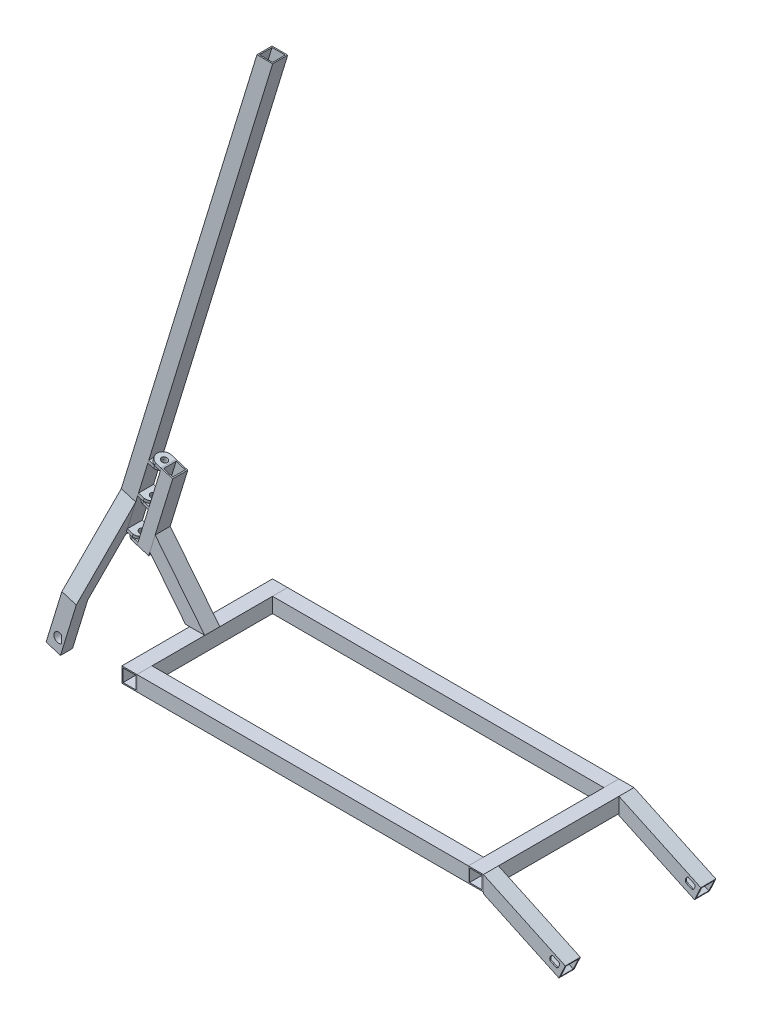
from build123d import *

# Parameters (mm, degrees)
SKETCH1_W                       = 25
SKETCH1_H                       = 25
SKETCH1_W_2                     = 21
SKETCH1_H_2                     = 21
BOSS_EXTRUDE1_DEPTH             = 550
BOSS_EXTRUDE1_2_DEPTH           = 550
SKETCH2_W                       = 25
SKETCH2_H                       = 25
SKETCH2_W_2                     = 21
SKETCH2_H_2                     = 21
BOSS_EXTRUDE2_DEPTH             = 250
SKETCH3_W                       = 25
SKETCH3_H                       = 25
SKETCH3_W_2                     = 21
SKETCH3_H_2                     = 21
BOSS_EXTRUDE3_DEPTH             = 250
BOSS_EXTRUDE4_DEPTH             = 25
CUT_EXTRUDE1_REACH              = 706.956
SKETCH5_W                       = 21
SKETCH5_H                       = 21
CUT_EXTRUDE2_START              = -250
CUT_EXTRUDE2_DEPTH              = 250
BOSS_EXTRUDE5_DEPTH             = 12.5
BOSS_EXTRUDE5_DEPTH_BACK        = 12.5
BOSS_EXTRUDE6_REACH             = 740.009
BOSS_EXTRUDE6_DIRECTION_2_REACH = 740.009
CUT_EXTRUDE3_REACH              = 1102.678
SKETCH10_W                      = 21
SKETCH10_H                      = 21
BOSS_EXTRUDE7_DEPTH             = 25
CUT_EXTRUDE4_DEPTH              = 25
SKETCH14_W                      = 25
SKETCH14_H                      = 136.591840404
BOSS_EXTRUDE8_DEPTH             = 20
SKETCH15_W                      = 16
SKETCH15_H                      = 21
CUT_EXTRUDE5_DEPTH              = 136.591840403
CUT_EXTRUDE6_DEPTH              = 20
SKETCH17_R                      = 5
BOSS_EXTRUDE9_DEPTH             = 5
SKETCH18_R                      = 5
BOSS_EXTRUDE10_DEPTH            = 5
SKETCH19_R                      = 5
BOSS_EXTRUDE11_DEPTH            = 5
SKETCH20_R                      = 5
BOSS_EXTRUDE12_DEPTH            = 5
SKETCH21_R                      = 5
BOSS_EXTRUDE13_DEPTH            = 5
SKETCH22_R                      = 5
BOSS_EXTRUDE14_DEPTH            = 5


with BuildPart() as part:
    # Sketch1 → Boss-Extrude1 (new body)
    with BuildSketch(Plane(origin=(0, 0, 0), x_dir=(0, 0, -1), z_dir=(1, 0, 0))):
        with Locations((-112.5, 0)):
            Rectangle(SKETCH1_W, SKETCH1_H)
        with Locations((-112.5, 0)):
            Rectangle(SKETCH1_W_2, SKETCH1_H_2, mode=Mode.SUBTRACT)
    extrude(amount=BOSS_EXTRUDE1_DEPTH)


with BuildPart() as body_2:
    # Sketch1 → Boss-Extrude1 2 (new body)
    with BuildSketch(Plane(origin=(0, 0, 0), x_dir=(0, 0, -1), z_dir=(1, 0, 0))):
        with Locations((112.5, 0)):
            Rectangle(SKETCH1_W, SKETCH1_H)
        with Locations((112.5, 0)):
            Rectangle(SKETCH1_W_2, SKETCH1_H_2, mode=Mode.SUBTRACT)
    extrude(amount=BOSS_EXTRUDE1_2_DEPTH)


with BuildPart() as body_3:
    # Sketch2 → Boss-Extrude2 (new body)
    with BuildSketch(Plane(origin=(0, 0, -125), x_dir=(-1, 0, 0), z_dir=(0, 0, -1))):
        with Locations((12.5, 0)):
            Rectangle(SKETCH2_W, SKETCH2_H)
        with Locations((12.5, 0)):
            Rectangle(SKETCH2_W_2, SKETCH2_H_2, mode=Mode.SUBTRACT)
    extrude(amount=-BOSS_EXTRUDE2_DEPTH)


with BuildPart() as body_4:
    # Sketch3 → Boss-Extrude3 (new body)
    with BuildSketch(Plane.XY.offset(125)):
        with Locations((562.5, 0)):
            Rectangle(SKETCH3_W, SKETCH3_H)
        with Locations((562.5, 0)):
            Rectangle(SKETCH3_W_2, SKETCH3_H_2, mode=Mode.SUBTRACT)
    extrude(amount=-BOSS_EXTRUDE3_DEPTH)


with BuildPart() as body_5:
    # Sketch4 → Boss-Extrude4 (new body)
    with BuildSketch(Plane.XY.offset(125)):
        Polygon((575, 12.5), (575, -15.084447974), (700.380711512, -73.550433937), (710.946168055, -50.892739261), align=None)
    extrude(amount=-BOSS_EXTRUDE4_DEPTH)

    # Cut-Extrude1: up to this plane
    cut_extrude1_end = Plane(origin=(575, 12.5, 100), z_dir=(-1, 0, 0))
    # Sketch5 → Cut-Extrude1 (cut, up to the surface)
    with BuildSketch(Plane(origin=(603.459828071, -281.397939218, 0), x_dir=(0, 0, -1), z_dir=(0.9063077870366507, -0.42261826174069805, 0)), mode=Mode.PRIVATE) as cut_extrude1_sk1:
        with Locations((-112.5, 241.834347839)):
            Rectangle(SKETCH5_W, SKETCH5_H)
    cut_extrude1_tool1 = split(extrude(cut_extrude1_sk1.sketch, amount=-CUT_EXTRUDE1_REACH, mode=Mode.PRIVATE), bisect_by=cut_extrude1_end, keep=Keep.BOTH, mode=Mode.PRIVATE)
    add(cut_extrude1_tool1.solids().sort_by_distance((705.66344, -62.221587, 112.5))[0], mode=Mode.SUBTRACT)


with BuildPart() as body_6:
    # Mirror2: mirrored copy
    add(body_5.part.mirror(Plane.XY))


with BuildPart() as cut_extrude2_tool:
    # Sketch7 → Cut-Extrude2 (new body)
    with BuildSketch(Plane(origin=(0, 0, -125), x_dir=(-1, 0, 0), z_dir=(0, 0, -1)).offset(CUT_EXTRUDE2_START)):
        with BuildLine():
            Line((-700.799500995, -51.356522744), (-689.92380755, -46.285103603))
            ThreePointArc((-689.92380755, -46.285103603), (-685.874906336, -50.235597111), (-685.45123627, -55.876563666))
            Line((-685.45123627, -55.876563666), (-696.326929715, -60.947982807))
            ThreePointArc((-696.326929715, -60.947982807), (-700.375830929, -56.997489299), (-700.799500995, -51.356522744))
        make_face()
    extrude(amount=CUT_EXTRUDE2_DEPTH)


with BuildPart() as body_5_1:
    add(body_5.part)

    # Cut-Extrude2: cut by cut_extrude2_tool
    add(cut_extrude2_tool.part, mode=Mode.SUBTRACT)


with BuildPart() as body_6_1:
    add(body_6.part)

    # Cut-Extrude2: cut by cut_extrude2_tool
    add(cut_extrude2_tool.part, mode=Mode.SUBTRACT)


with BuildPart() as body_7:
    # Sketch8 → Boss-Extrude5 (new, two sides: drawn at the far end of the back side and taken through both)
    with BuildSketch(Plane.XY.offset(-BOSS_EXTRUDE5_DEPTH_BACK)):
        Polygon((0, 12.5), (-112.52508315, 153.585441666), (-121.386292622, 124.601731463), (-31.977658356, 12.5), align=None)
    extrude(amount=BOSS_EXTRUDE5_DEPTH + BOSS_EXTRUDE5_DEPTH_BACK)


with BuildPart() as body_8:

    # Boss-Extrude6: up to this face of the body (flat: up to its plane)
    boss_extrude6_end = Plane(body_7.part.faces().sort_by_distance((-66.08267129, 76.073286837, 12.5))[0])
    # Sketch9 → Boss-Extrude6 (new, up to the picked face)
    with BuildSketch(Plane.XY, mode=Mode.PRIVATE) as boss_extrude6_sk1:
        Polygon((-131.351338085, 92.007536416), (-155.258956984, 99.316829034), (86.636741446, 890.522007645), (112.779035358, 890.522007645), align=None)
    boss_extrude6_tool1 = split(extrude(boss_extrude6_sk1.sketch, amount=BOSS_EXTRUDE6_REACH, mode=Mode.PRIVATE), bisect_by=boss_extrude6_end, keep=Keep.BOTH, mode=Mode.PRIVATE)
    add(boss_extrude6_tool1.solids().sort_by(Axis((-21.779453, 493.089295, 0), (0, 0, 1)))[0])


    # Boss-Extrude6 direction 2: up to this face of the body (flat: up to its plane)
    boss_extrude6_direction_2_end = Plane(body_7.part.faces().sort_by_distance((-66.08267129, 76.073286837, -12.5))[0])
    # Sketch9 → Boss-Extrude6 direction 2 (add, up to the picked face)
    with BuildSketch(Plane.XY, mode=Mode.PRIVATE) as boss_extrude6_direction_2_sk1:
        Polygon((-131.351338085, 92.007536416), (-155.258956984, 99.316829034), (86.636741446, 890.522007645), (112.779035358, 890.522007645), align=None)
    boss_extrude6_direction_2_tool1 = split(extrude(boss_extrude6_direction_2_sk1.sketch, amount=-BOSS_EXTRUDE6_DIRECTION_2_REACH, mode=Mode.PRIVATE), bisect_by=boss_extrude6_direction_2_end, keep=Keep.BOTH, mode=Mode.PRIVATE)
    add(boss_extrude6_direction_2_tool1.solids().sort_by(Axis((-21.779453, 493.089295, 0), (0, 0, -1)))[0])

    # Cut-Extrude3: up to this plane
    cut_extrude3_end = Plane(origin=(86.636741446, 890.522007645, 854.800258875), z_dir=(0, -1, 0))
    # Sketch10 → Cut-Extrude3 (cut, up to the surface)
    with BuildSketch(Plane(origin=(14.496908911, 47.417252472, 0), x_dir=(0.9563047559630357, -0.2923717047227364, 0), z_dir=(-0.2923717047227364, -0.9563047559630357, 0)), mode=Mode.PRIVATE) as cut_extrude3_sk1:
        with Locations((-165.012309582, 0)):
            Rectangle(SKETCH10_W, SKETCH10_H)
    cut_extrude3_tool1 = split(extrude(cut_extrude3_sk1.sketch, amount=-CUT_EXTRUDE3_REACH, mode=Mode.PRIVATE), bisect_by=cut_extrude3_end, keep=Keep.BOTH, mode=Mode.PRIVATE)
    add(cut_extrude3_tool1.solids().sort_by_distance((-143.305148, 95.662183, 0))[0], mode=Mode.SUBTRACT)


with BuildPart() as body_9:
    # Sketch11 → Boss-Extrude7 (new body)
    with BuildSketch(Plane(origin=(-169.755865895, 51.899576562, 0), x_dir=(0, 0, 1), z_dir=(-0.9563047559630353, 0.2923717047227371, 0))):
        Polygon((12.5, 49.583830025), (47.714066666, -45.184859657), (47.714066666, -131.162182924), (67.714066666, -131.162182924), (67.714066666, -41.589171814), (12.5, 107.003854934), align=None)
    extrude(amount=-BOSS_EXTRUDE7_DEPTH)

    # Sketch16 → Cut-Extrude6 (cut)
    with BuildSketch(Plane.XY.offset(67.714066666)):
        with BuildLine():
            Line((-182.312417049, -50.584871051), (-182.312417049, -63.074867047))
            ThreePointArc((-182.312417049, -63.074867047), (-195.312417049, -56.829869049), (-182.312417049, -50.584871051))
        make_face()
    extrude(amount=-CUT_EXTRUDE6_DEPTH, mode=Mode.SUBTRACT)


with BuildPart() as body_7_1:
    add(body_7.part)

    # Sketch12 → Cut-Extrude4 (cut)
    with BuildSketch(Plane.XY.offset(12.5)):
        Polygon((-121.386292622, 124.601731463), (-112.52508315, 153.585441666), (-82.288122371, 115.673939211), (-91.149331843, 86.690229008), align=None)
    extrude(amount=-CUT_EXTRUDE4_DEPTH, mode=Mode.SUBTRACT)


with BuildPart() as body_10:
    # Sketch14 → Boss-Extrude8 (new body)
    with BuildSketch(Plane(origin=(-107.596056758, 32.895415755, 0), x_dir=(0, 0, 1), z_dir=(-0.9563047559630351, 0.2923717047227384, 0))):
        with Locations((0, 117.879750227)):
            Rectangle(SKETCH14_W, SKETCH14_H)
    extrude(amount=BOSS_EXTRUDE8_DEPTH)

    # Sketch15 → Cut-Extrude5 (cut)
    with BuildSketch(Plane(origin=(54.432498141, 178.040679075, 0), x_dir=(0.9563047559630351, -0.29237170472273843, 0), z_dir=(0.29237170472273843, 0.9563047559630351, 0))):
        with Locations((-122.512309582, 0)):
            Rectangle(SKETCH15_W, SKETCH15_H)
    extrude(amount=-CUT_EXTRUDE5_DEPTH, mode=Mode.SUBTRACT)


with BuildPart() as body_11:
    # Sketch17 → Boss-Extrude9 (new body)
    with BuildSketch(Plane(origin=(54.432498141, 178.040679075, 0), x_dir=(0.9563047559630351, -0.29237170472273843, 0), z_dir=(0.29237170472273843, 0.9563047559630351, 0))):
        with BuildLine():
            Line((-132.512309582, 12.5), (-132.512309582, -12.5))
            Line((-132.512309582, -12.5), (-142.512309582, -12.5))
            ThreePointArc((-142.512309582, -12.5), (-152.512309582, 0), (-142.512309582, 12.5))
            Line((-142.512309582, 12.5), (-132.512309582, 12.5))
        make_face()
        with Locations(Location((-139.699809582, 0, 0), (0, 0, 180))):
            Circle(SKETCH17_R, mode=Mode.SUBTRACT)
    extrude(amount=-BOSS_EXTRUDE9_DEPTH)


with BuildPart() as body_12:
    # Sketch18 → Boss-Extrude10 (new body)
    with BuildSketch(Plane(origin=(14.496908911, 47.417252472, 0), x_dir=(0.9563047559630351, -0.29237170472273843, 0), z_dir=(-0.29237170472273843, -0.9563047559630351, 0))):
        with BuildLine():
            Line((-142.512309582, -12.5), (-132.512309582, -12.5))
            Line((-132.512309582, -12.5), (-132.512309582, 12.5))
            Line((-132.512309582, 12.5), (-142.512309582, 12.5))
            ThreePointArc((-142.512309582, 12.5), (-152.512309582, 0), (-142.512309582, -12.5))
        make_face()
        with Locations((-139.699809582, 0)):
            Circle(SKETCH18_R, mode=Mode.SUBTRACT)
    extrude(amount=-BOSS_EXTRUDE10_DEPTH)


with BuildPart() as body_13:
    # Sketch19 → Boss-Extrude11 (new body)
    with BuildSketch(Plane(origin=(34.464703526, 112.728965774, 0), x_dir=(-0.9563047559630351, 0.29237170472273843, 0), z_dir=(-0.29237170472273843, -0.9563047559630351, 0))):
        with BuildLine():
            Line((132.512309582, 12.5), (132.512309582, -12.5))
            Line((132.512309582, -12.5), (142.512309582, -12.5))
            ThreePointArc((142.512309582, -12.5), (152.512309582, 0), (142.512309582, 12.5))
            Line((142.512309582, 12.5), (132.512309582, 12.5))
        make_face()
        with Locations(Location((139.699809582, 0, 0), (0, 0, 180))):
            Circle(SKETCH19_R, mode=Mode.SUBTRACT)
    extrude(amount=BOSS_EXTRUDE11_DEPTH)


with BuildPart() as body_14:
    # Sketch20 → Boss-Extrude12 (new body)
    with BuildSketch(Plane(origin=(52.970639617, 173.259155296, 0), x_dir=(0.9563047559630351, -0.2923717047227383, 0), z_dir=(-0.2923717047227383, -0.9563047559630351, 0))):
        with BuildLine():
            Line((-152.512309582, 12.5), (-152.512309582, -12.5))
            Line((-152.512309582, -12.5), (-142.512309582, -12.5))
            ThreePointArc((-142.512309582, -12.5), (-132.512309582, 0), (-142.512309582, 12.5))
            Line((-142.512309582, 12.5), (-152.512309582, 12.5))
        make_face()
        with Locations((-139.699809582, 0)):
            Circle(SKETCH20_R, mode=Mode.SUBTRACT)
    extrude(amount=BOSS_EXTRUDE12_DEPTH)


with BuildPart() as body_15:
    # Sketch21 → Boss-Extrude13 (new body)
    with BuildSketch(Plane(origin=(34.464703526, 112.728965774, 0), x_dir=(0.956304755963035, -0.29237170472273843, 0), z_dir=(0.29237170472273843, 0.956304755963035, 0))):
        with BuildLine():
            Line((-152.512309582, -12.5), (-142.512309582, -12.5))
            ThreePointArc((-142.512309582, -12.5), (-132.512309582, 0), (-142.512309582, 12.5))
            Line((-142.512309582, 12.5), (-152.512309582, 12.5))
            Line((-152.512309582, 12.5), (-152.512309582, -12.5))
        make_face()
        with Locations(Location((-139.699809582, 0, 0), (0, 0, 180))):
            Circle(SKETCH21_R, mode=Mode.SUBTRACT)
    extrude(amount=BOSS_EXTRUDE13_DEPTH)


with BuildPart() as body_16:
    # Sketch22 → Boss-Extrude14 (new body)
    with BuildSketch(Plane(origin=(15.958767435, 52.198776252, 0), x_dir=(0.9563047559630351, -0.2923717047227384, 0), z_dir=(0.2923717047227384, 0.9563047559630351, 0))):
        with BuildLine():
            Line((-142.512309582, 12.5), (-152.512309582, 12.5))
            Line((-152.512309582, 12.5), (-152.512309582, -12.5))
            Line((-152.512309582, -12.5), (-142.512309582, -12.5))
            ThreePointArc((-142.512309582, -12.5), (-132.512309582, 0), (-142.512309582, 12.5))
        make_face()
        with Locations(Location((-139.699809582, 0, 0), (0, 0, 180))):
            Circle(SKETCH22_R, mode=Mode.SUBTRACT)
    extrude(amount=BOSS_EXTRUDE14_DEPTH)


solid = Compound([part.part, body_2.part, body_3.part, body_4.part, body_5_1.part, body_6_1.part, body_8.part, body_9.part, body_7_1.part, body_10.part, body_11.part, body_12.part, body_13.part, body_14.part, body_15.part, body_16.part])
